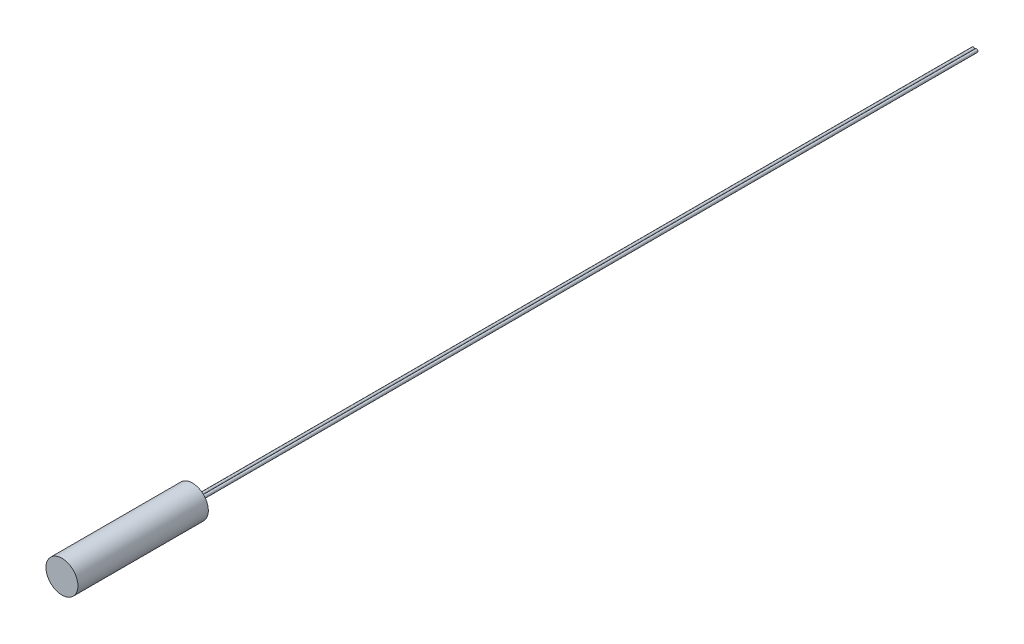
from build123d import *

# Parameters (mm, degrees)
SKETCH3_R           = 3.1115
BOSS_EXTRUDE1_DEPTH = 25.4
SKETCH12_R          = 0.3
BOSS_EXTRUDE4_DEPTH = 152.4


with BuildPart() as part:
    # Sketch3 → Boss-Extrude1 (new body)
    with BuildSketch(Plane.XY):
        with Locations((0, -3.1115)):
            Circle(SKETCH3_R)
    extrude(amount=-BOSS_EXTRUDE1_DEPTH)

    # Sketch12 → Boss-Extrude4 (add)
    with BuildSketch(Plane(origin=(0, 0, -25.4), x_dir=(-1, 0, 0), z_dir=(0, 0, -1))):
        with Locations(Location((-0.303, -3.1115, 0), (0, 0, 180))):
            Circle(SKETCH12_R)
        with Locations(Location((0.303, -3.1115, 0), (0, 0, 180))):
            Circle(SKETCH12_R)
    extrude(amount=BOSS_EXTRUDE4_DEPTH)


solid = part.part
